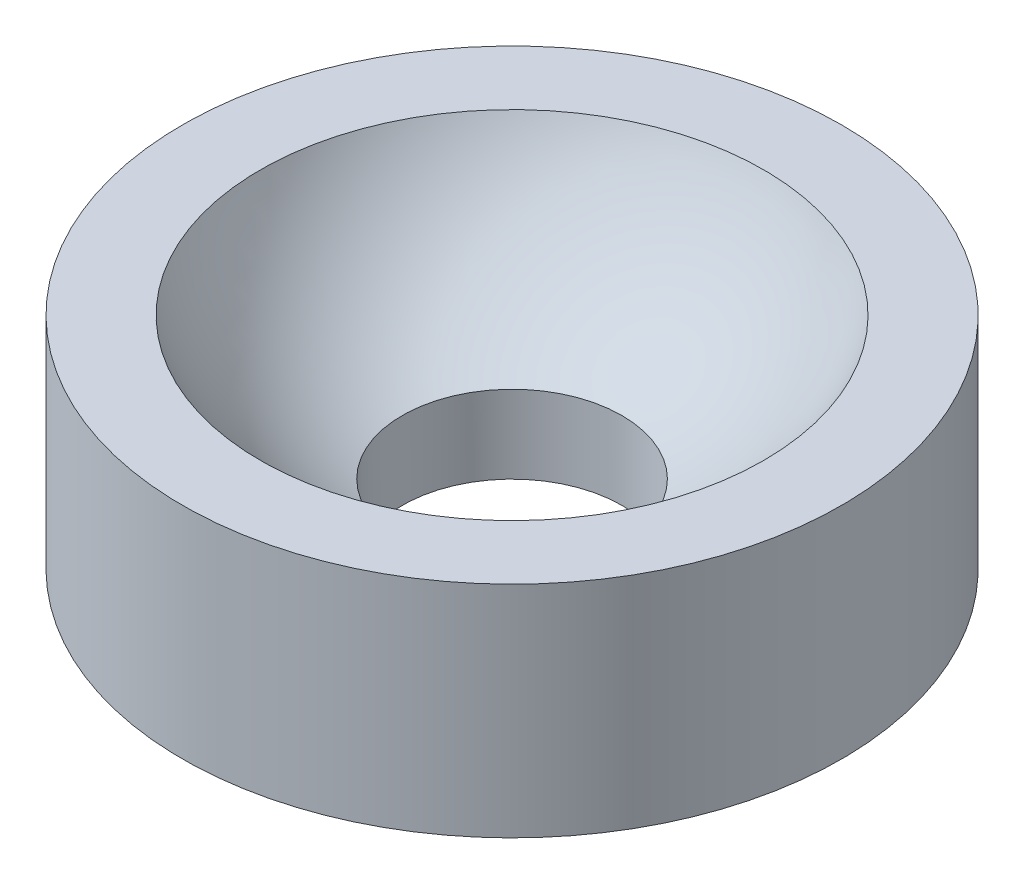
from build123d import *

# Parameters (mm, degrees)
SZKIC2_R                   = 2
WYTNIJ_WYCI_GNI_CIE1_DEPTH = 10


with BuildPart() as part:
    # Szkic1 → Obr_t1 (revolve)
    with BuildSketch(Plane.XY):
        with BuildLine():
            Line((0, 0), (6, 0))
            Line((6, 0), (6, 4))
            Line((6, 4), (4.582575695, 4))
            ThreePointArc((4.582575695, 4), (2.738612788, 1.816699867), (0, 1))
            Line((0, 1), (0, 0))
        make_face()
    revolve(axis=Axis((0, 0, 0), (0, 1, 0)))

    # Szkic2 → Wytnij-wyci_gni_cie1 (cut)
    with BuildSketch(Plane.XZ):
        with Locations(Location((0, 0, 0), (0, 0, 270))):
            Circle(SZKIC2_R)
    extrude(amount=-WYTNIJ_WYCI_GNI_CIE1_DEPTH, mode=Mode.SUBTRACT)


solid = part.part
